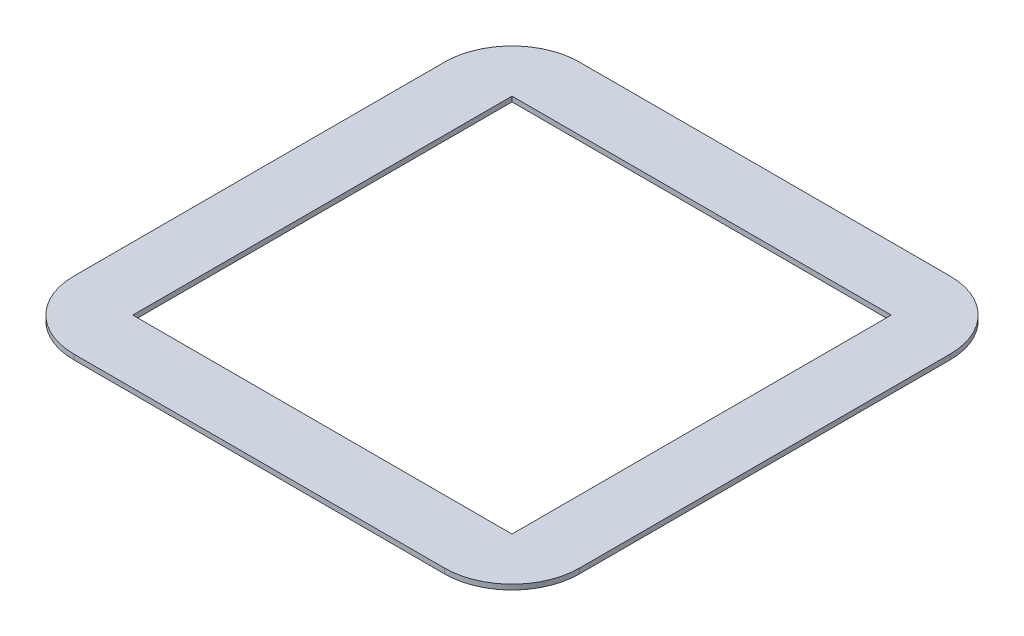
ISO-10303-21;
HEADER;
FILE_DESCRIPTION(('STEP AP214'),'2;1');
FILE_NAME('part.step','',(''),(''),'','','');
FILE_SCHEMA(('AUTOMOTIVE_DESIGN { 1 0 10303 214 1 1 1 1 }'));
ENDSEC;
DATA;
#1=APPLICATION_CONTEXT('core data for automotive mechanical design processes');
#2=APPLICATION_PROTOCOL_DEFINITION('international standard','automotive_design',2000,#1);
#3=PRODUCT_CONTEXT('',#1,'mechanical');
#4=PRODUCT('Part','Part','',(#3));
#5=PRODUCT_RELATED_PRODUCT_CATEGORY('part','',(#4));
#6=PRODUCT_DEFINITION_FORMATION('','',#4);
#7=PRODUCT_DEFINITION_CONTEXT('part definition',#1,'design');
#8=PRODUCT_DEFINITION('design','',#6,#7);
#9=PRODUCT_DEFINITION_SHAPE('','',#8);
#10=(LENGTH_UNIT() NAMED_UNIT(*) SI_UNIT(.MILLI.,.METRE.));
#11=(NAMED_UNIT(*) PLANE_ANGLE_UNIT() SI_UNIT($,.RADIAN.));
#12=(NAMED_UNIT(*) SI_UNIT($,.STERADIAN.) SOLID_ANGLE_UNIT());
#13=UNCERTAINTY_MEASURE_WITH_UNIT(LENGTH_MEASURE(1.E-05),#10,'distance_accuracy_value','');
#14=(GEOMETRIC_REPRESENTATION_CONTEXT(3) GLOBAL_UNCERTAINTY_ASSIGNED_CONTEXT((#13)) GLOBAL_UNIT_ASSIGNED_CONTEXT((#10,
#11,#12)) REPRESENTATION_CONTEXT('',''));
#15=CARTESIAN_POINT('',(0.,0.,0.));
#16=DIRECTION('',(0.,0.,1.));
#17=DIRECTION('',(1.,0.,0.));
#18=AXIS2_PLACEMENT_3D('',#15,#16,#17);
#19=CARTESIAN_POINT('',(0.,3.,0.));
#20=DIRECTION('',(0.,1.,0.));
#21=DIRECTION('',(0.,0.,1.));
#22=AXIS2_PLACEMENT_3D('',#19,#20,#21);
#23=PLANE('',#22);
#24=DIRECTION('',(-1.,0.,0.));
#25=VECTOR('',#24,1.);
#26=CARTESIAN_POINT('',(-150.,3.,-150.));
#27=LINE('',#26,#25);
#28=CARTESIAN_POINT('',(110.,3.,-150.));
#29=VERTEX_POINT('',#28);
#30=CARTESIAN_POINT('',(-110.,3.,-150.));
#31=VERTEX_POINT('',#30);
#32=EDGE_CURVE('E168',#29,#31,#27,.T.);
#33=ORIENTED_EDGE('',*,*,#32,.T.);
#34=CARTESIAN_POINT('',(-110.,3.,-110.));
#35=DIRECTION('',(0.,1.,0.));
#36=DIRECTION('',(0.,0.,1.));
#37=AXIS2_PLACEMENT_3D('',#34,#35,#36);
#38=CIRCLE('',#37,40.);
#39=CARTESIAN_POINT('',(-150.,3.,-110.));
#40=VERTEX_POINT('',#39);
#41=EDGE_CURVE('E208',#31,#40,#38,.T.);
#42=ORIENTED_EDGE('',*,*,#41,.T.);
#43=DIRECTION('',(0.,0.,1.));
#44=VECTOR('',#43,1.);
#45=CARTESIAN_POINT('',(-150.,3.,-150.));
#46=LINE('',#45,#44);
#47=CARTESIAN_POINT('',(-150.,3.,110.));
#48=VERTEX_POINT('',#47);
#49=EDGE_CURVE('E172',#40,#48,#46,.T.);
#50=ORIENTED_EDGE('',*,*,#49,.T.);
#51=CARTESIAN_POINT('',(-110.,3.,110.));
#52=DIRECTION('',(0.,1.,0.));
#53=DIRECTION('',(0.,0.,1.));
#54=AXIS2_PLACEMENT_3D('',#51,#52,#53);
#55=CIRCLE('',#54,40.);
#56=CARTESIAN_POINT('',(-110.,3.,150.));
#57=VERTEX_POINT('',#56);
#58=EDGE_CURVE('E55',#48,#57,#55,.T.);
#59=ORIENTED_EDGE('',*,*,#58,.T.);
#60=DIRECTION('',(1.,0.,0.));
#61=VECTOR('',#60,1.);
#62=CARTESIAN_POINT('',(-150.,3.,150.));
#63=LINE('',#62,#61);
#64=CARTESIAN_POINT('',(110.,3.,150.));
#65=VERTEX_POINT('',#64);
#66=EDGE_CURVE('E174',#57,#65,#63,.T.);
#67=ORIENTED_EDGE('',*,*,#66,.T.);
#68=CARTESIAN_POINT('',(110.,3.,110.));
#69=DIRECTION('',(0.,1.,0.));
#70=DIRECTION('',(0.,0.,1.));
#71=AXIS2_PLACEMENT_3D('',#68,#69,#70);
#72=CIRCLE('',#71,40.);
#73=CARTESIAN_POINT('',(150.,3.,110.));
#74=VERTEX_POINT('',#73);
#75=EDGE_CURVE('E203',#65,#74,#72,.T.);
#76=ORIENTED_EDGE('',*,*,#75,.T.);
#77=DIRECTION('',(0.,0.,-1.));
#78=VECTOR('',#77,1.);
#79=CARTESIAN_POINT('',(150.,3.,-150.));
#80=LINE('',#79,#78);
#81=CARTESIAN_POINT('',(150.,3.,-110.));
#82=VERTEX_POINT('',#81);
#83=EDGE_CURVE('E165',#74,#82,#80,.T.);
#84=ORIENTED_EDGE('',*,*,#83,.T.);
#85=CARTESIAN_POINT('',(110.,3.,-110.));
#86=DIRECTION('',(0.,1.,0.));
#87=DIRECTION('',(0.,0.,1.));
#88=AXIS2_PLACEMENT_3D('',#85,#86,#87);
#89=CIRCLE('',#88,40.);
#90=EDGE_CURVE('E205',#82,#29,#89,.T.);
#91=ORIENTED_EDGE('',*,*,#90,.T.);
#92=EDGE_LOOP('',(#33,#42,#50,#59,#67,#76,#84,#91));
#93=FACE_BOUND('',#92,.T.);
#94=DIRECTION('',(1.,0.,0.));
#95=VECTOR('',#94,1.);
#96=CARTESIAN_POINT('',(112.5,3.,112.5));
#97=LINE('',#96,#95);
#98=CARTESIAN_POINT('',(-112.5,3.,112.5));
#99=VERTEX_POINT('',#98);
#100=CARTESIAN_POINT('',(112.5,3.,112.5));
#101=VERTEX_POINT('',#100);
#102=EDGE_CURVE('E134',#99,#101,#97,.T.);
#103=ORIENTED_EDGE('',*,*,#102,.F.);
#104=DIRECTION('',(0.,0.,1.));
#105=VECTOR('',#104,1.);
#106=CARTESIAN_POINT('',(-112.5,3.,-112.5));
#107=LINE('',#106,#105);
#108=CARTESIAN_POINT('',(-112.5,3.,-112.5));
#109=VERTEX_POINT('',#108);
#110=EDGE_CURVE('E124',#109,#99,#107,.T.);
#111=ORIENTED_EDGE('',*,*,#110,.F.);
#112=DIRECTION('',(-1.,0.,0.));
#113=VECTOR('',#112,1.);
#114=CARTESIAN_POINT('',(112.5,3.,-112.5));
#115=LINE('',#114,#113);
#116=CARTESIAN_POINT('',(112.5,3.,-112.5));
#117=VERTEX_POINT('',#116);
#118=EDGE_CURVE('E149',#117,#109,#115,.T.);
#119=ORIENTED_EDGE('',*,*,#118,.F.);
#120=DIRECTION('',(0.,0.,-1.));
#121=VECTOR('',#120,1.);
#122=CARTESIAN_POINT('',(112.5,3.,-112.5));
#123=LINE('',#122,#121);
#124=EDGE_CURVE('E147',#101,#117,#123,.T.);
#125=ORIENTED_EDGE('',*,*,#124,.F.);
#126=EDGE_LOOP('',(#103,#111,#119,#125));
#127=FACE_BOUND('',#126,.T.);
#128=ADVANCED_FACE('F33',(#93,#127),#23,.T.);
#129=CARTESIAN_POINT('',(0.,0.,0.));
#130=DIRECTION('',(0.,1.,0.));
#131=DIRECTION('',(0.,0.,1.));
#132=AXIS2_PLACEMENT_3D('',#129,#130,#131);
#133=PLANE('',#132);
#134=DIRECTION('',(0.,0.,1.));
#135=VECTOR('',#134,1.);
#136=CARTESIAN_POINT('',(-150.,0.,-150.));
#137=LINE('',#136,#135);
#138=CARTESIAN_POINT('',(-150.,0.,-110.));
#139=VERTEX_POINT('',#138);
#140=CARTESIAN_POINT('',(-150.,0.,110.));
#141=VERTEX_POINT('',#140);
#142=EDGE_CURVE('E182',#139,#141,#137,.T.);
#143=ORIENTED_EDGE('',*,*,#142,.F.);
#144=CARTESIAN_POINT('',(-110.,0.,-110.));
#145=DIRECTION('',(0.,1.,0.));
#146=DIRECTION('',(0.,0.,1.));
#147=AXIS2_PLACEMENT_3D('',#144,#145,#146);
#148=CIRCLE('',#147,40.);
#149=CARTESIAN_POINT('',(-110.,0.,-150.));
#150=VERTEX_POINT('',#149);
#151=EDGE_CURVE('E196',#139,#150,#148,.F.);
#152=ORIENTED_EDGE('',*,*,#151,.T.);
#153=DIRECTION('',(-1.,0.,0.));
#154=VECTOR('',#153,1.);
#155=CARTESIAN_POINT('',(-150.,0.,-150.));
#156=LINE('',#155,#154);
#157=CARTESIAN_POINT('',(110.,0.,-150.));
#158=VERTEX_POINT('',#157);
#159=EDGE_CURVE('E179',#158,#150,#156,.T.);
#160=ORIENTED_EDGE('',*,*,#159,.F.);
#161=CARTESIAN_POINT('',(110.,0.,-110.));
#162=DIRECTION('',(0.,1.,0.));
#163=DIRECTION('',(0.,0.,1.));
#164=AXIS2_PLACEMENT_3D('',#161,#162,#163);
#165=CIRCLE('',#164,40.);
#166=CARTESIAN_POINT('',(150.,0.,-110.));
#167=VERTEX_POINT('',#166);
#168=EDGE_CURVE('E192',#158,#167,#165,.F.);
#169=ORIENTED_EDGE('',*,*,#168,.T.);
#170=DIRECTION('',(0.,0.,-1.));
#171=VECTOR('',#170,1.);
#172=CARTESIAN_POINT('',(150.,0.,-150.));
#173=LINE('',#172,#171);
#174=CARTESIAN_POINT('',(150.,0.,110.));
#175=VERTEX_POINT('',#174);
#176=EDGE_CURVE('E142',#175,#167,#173,.T.);
#177=ORIENTED_EDGE('',*,*,#176,.F.);
#178=CARTESIAN_POINT('',(110.,0.,110.));
#179=DIRECTION('',(0.,1.,0.));
#180=DIRECTION('',(0.,0.,1.));
#181=AXIS2_PLACEMENT_3D('',#178,#179,#180);
#182=CIRCLE('',#181,40.);
#183=CARTESIAN_POINT('',(110.,0.,150.));
#184=VERTEX_POINT('',#183);
#185=EDGE_CURVE('E190',#175,#184,#182,.F.);
#186=ORIENTED_EDGE('',*,*,#185,.T.);
#187=DIRECTION('',(1.,0.,0.));
#188=VECTOR('',#187,1.);
#189=CARTESIAN_POINT('',(-150.,0.,150.));
#190=LINE('',#189,#188);
#191=CARTESIAN_POINT('',(-110.,0.,150.));
#192=VERTEX_POINT('',#191);
#193=EDGE_CURVE('E169',#192,#184,#190,.T.);
#194=ORIENTED_EDGE('',*,*,#193,.F.);
#195=CARTESIAN_POINT('',(-110.,0.,110.));
#196=DIRECTION('',(0.,1.,0.));
#197=DIRECTION('',(0.,0.,1.));
#198=AXIS2_PLACEMENT_3D('',#195,#196,#197);
#199=CIRCLE('',#198,40.);
#200=EDGE_CURVE('E194',#192,#141,#199,.F.);
#201=ORIENTED_EDGE('',*,*,#200,.T.);
#202=EDGE_LOOP('',(#143,#152,#160,#169,#177,#186,#194,#201));
#203=FACE_BOUND('',#202,.T.);
#204=DIRECTION('',(0.,0.,1.));
#205=VECTOR('',#204,1.);
#206=CARTESIAN_POINT('',(-112.5,0.,-112.5));
#207=LINE('',#206,#205);
#208=CARTESIAN_POINT('',(-112.5,0.,-112.5));
#209=VERTEX_POINT('',#208);
#210=CARTESIAN_POINT('',(-112.5,0.,112.5));
#211=VERTEX_POINT('',#210);
#212=EDGE_CURVE('E153',#209,#211,#207,.T.);
#213=ORIENTED_EDGE('',*,*,#212,.T.);
#214=DIRECTION('',(1.,0.,0.));
#215=VECTOR('',#214,1.);
#216=CARTESIAN_POINT('',(112.5,0.,112.5));
#217=LINE('',#216,#215);
#218=CARTESIAN_POINT('',(112.5,0.,112.5));
#219=VERTEX_POINT('',#218);
#220=EDGE_CURVE('E141',#211,#219,#217,.T.);
#221=ORIENTED_EDGE('',*,*,#220,.T.);
#222=DIRECTION('',(0.,0.,-1.));
#223=VECTOR('',#222,1.);
#224=CARTESIAN_POINT('',(112.5,0.,-112.5));
#225=LINE('',#224,#223);
#226=CARTESIAN_POINT('',(112.5,0.,-112.5));
#227=VERTEX_POINT('',#226);
#228=EDGE_CURVE('E156',#219,#227,#225,.T.);
#229=ORIENTED_EDGE('',*,*,#228,.T.);
#230=DIRECTION('',(-1.,0.,0.));
#231=VECTOR('',#230,1.);
#232=CARTESIAN_POINT('',(112.5,0.,-112.5));
#233=LINE('',#232,#231);
#234=EDGE_CURVE('E135',#227,#209,#233,.T.);
#235=ORIENTED_EDGE('',*,*,#234,.T.);
#236=EDGE_LOOP('',(#213,#221,#229,#235));
#237=FACE_BOUND('',#236,.T.);
#238=ADVANCED_FACE('F224',(#203,#237),#133,.F.);
#239=CARTESIAN_POINT('',(150.,3.,-150.));
#240=DIRECTION('',(-1.,0.,0.));
#241=DIRECTION('',(0.,0.,1.));
#242=AXIS2_PLACEMENT_3D('',#239,#240,#241);
#243=PLANE('',#242);
#244=ORIENTED_EDGE('',*,*,#176,.T.);
#245=DIRECTION('',(0.,-1.,0.));
#246=VECTOR('',#245,1.);
#247=CARTESIAN_POINT('',(150.,3.,-110.));
#248=LINE('',#247,#246);
#249=EDGE_CURVE('E11',#167,#82,#248,.F.);
#250=ORIENTED_EDGE('',*,*,#249,.T.);
#251=ORIENTED_EDGE('',*,*,#83,.F.);
#252=DIRECTION('',(0.,-1.,0.));
#253=VECTOR('',#252,1.);
#254=CARTESIAN_POINT('',(150.,3.,110.));
#255=LINE('',#254,#253);
#256=EDGE_CURVE('E41',#74,#175,#255,.T.);
#257=ORIENTED_EDGE('',*,*,#256,.T.);
#258=EDGE_LOOP('',(#244,#250,#251,#257));
#259=FACE_BOUND('',#258,.T.);
#260=ADVANCED_FACE('F218',(#259),#243,.F.);
#261=CARTESIAN_POINT('',(-150.,3.,-150.));
#262=DIRECTION('',(0.,0.,1.));
#263=DIRECTION('',(1.,0.,0.));
#264=AXIS2_PLACEMENT_3D('',#261,#262,#263);
#265=PLANE('',#264);
#266=ORIENTED_EDGE('',*,*,#159,.T.);
#267=DIRECTION('',(0.,-1.,0.));
#268=VECTOR('',#267,1.);
#269=CARTESIAN_POINT('',(-110.,3.,-150.));
#270=LINE('',#269,#268);
#271=EDGE_CURVE('E201',#150,#31,#270,.F.);
#272=ORIENTED_EDGE('',*,*,#271,.T.);
#273=ORIENTED_EDGE('',*,*,#32,.F.);
#274=DIRECTION('',(0.,-1.,0.));
#275=VECTOR('',#274,1.);
#276=CARTESIAN_POINT('',(110.,3.,-150.));
#277=LINE('',#276,#275);
#278=EDGE_CURVE('E198',#29,#158,#277,.T.);
#279=ORIENTED_EDGE('',*,*,#278,.T.);
#280=EDGE_LOOP('',(#266,#272,#273,#279));
#281=FACE_BOUND('',#280,.T.);
#282=ADVANCED_FACE('F234',(#281),#265,.F.);
#283=CARTESIAN_POINT('',(-150.,3.,-150.));
#284=DIRECTION('',(1.,0.,0.));
#285=DIRECTION('',(0.,0.,-1.));
#286=AXIS2_PLACEMENT_3D('',#283,#284,#285);
#287=PLANE('',#286);
#288=ORIENTED_EDGE('',*,*,#49,.F.);
#289=DIRECTION('',(0.,-1.,0.));
#290=VECTOR('',#289,1.);
#291=CARTESIAN_POINT('',(-150.,3.,-110.));
#292=LINE('',#291,#290);
#293=EDGE_CURVE('E187',#40,#139,#292,.T.);
#294=ORIENTED_EDGE('',*,*,#293,.T.);
#295=ORIENTED_EDGE('',*,*,#142,.T.);
#296=DIRECTION('',(0.,-1.,0.));
#297=VECTOR('',#296,1.);
#298=CARTESIAN_POINT('',(-150.,3.,110.));
#299=LINE('',#298,#297);
#300=EDGE_CURVE('E176',#141,#48,#299,.F.);
#301=ORIENTED_EDGE('',*,*,#300,.T.);
#302=EDGE_LOOP('',(#288,#294,#295,#301));
#303=FACE_BOUND('',#302,.T.);
#304=ADVANCED_FACE('F242',(#303),#287,.F.);
#305=CARTESIAN_POINT('',(-150.,3.,150.));
#306=DIRECTION('',(0.,0.,-1.));
#307=DIRECTION('',(-1.,0.,0.));
#308=AXIS2_PLACEMENT_3D('',#305,#306,#307);
#309=PLANE('',#308);
#310=ORIENTED_EDGE('',*,*,#66,.F.);
#311=DIRECTION('',(0.,-1.,0.));
#312=VECTOR('',#311,1.);
#313=CARTESIAN_POINT('',(-110.,3.,150.));
#314=LINE('',#313,#312);
#315=EDGE_CURVE('E211',#57,#192,#314,.T.);
#316=ORIENTED_EDGE('',*,*,#315,.T.);
#317=ORIENTED_EDGE('',*,*,#193,.T.);
#318=DIRECTION('',(0.,-1.,0.));
#319=VECTOR('',#318,1.);
#320=CARTESIAN_POINT('',(110.,3.,150.));
#321=LINE('',#320,#319);
#322=EDGE_CURVE('E48',#184,#65,#321,.F.);
#323=ORIENTED_EDGE('',*,*,#322,.T.);
#324=EDGE_LOOP('',(#310,#316,#317,#323));
#325=FACE_BOUND('',#324,.T.);
#326=ADVANCED_FACE('F247',(#325),#309,.F.);
#327=CARTESIAN_POINT('',(-112.5,3.,-112.5));
#328=DIRECTION('',(1.,0.,0.));
#329=DIRECTION('',(0.,0.,-1.));
#330=AXIS2_PLACEMENT_3D('',#327,#328,#329);
#331=PLANE('',#330);
#332=ORIENTED_EDGE('',*,*,#212,.F.);
#333=DIRECTION('',(0.,-1.,0.));
#334=VECTOR('',#333,1.);
#335=CARTESIAN_POINT('',(-112.5,3.,-112.5));
#336=LINE('',#335,#334);
#337=EDGE_CURVE('E130',#109,#209,#336,.T.);
#338=ORIENTED_EDGE('',*,*,#337,.F.);
#339=ORIENTED_EDGE('',*,*,#110,.T.);
#340=DIRECTION('',(0.,-1.,0.));
#341=VECTOR('',#340,1.);
#342=CARTESIAN_POINT('',(-112.5,3.,112.5));
#343=LINE('',#342,#341);
#344=EDGE_CURVE('E127',#99,#211,#343,.T.);
#345=ORIENTED_EDGE('',*,*,#344,.T.);
#346=EDGE_LOOP('',(#332,#338,#339,#345));
#347=FACE_BOUND('',#346,.T.);
#348=ADVANCED_FACE('F126',(#347),#331,.T.);
#349=CARTESIAN_POINT('',(112.5,3.,112.5));
#350=DIRECTION('',(0.,0.,-1.));
#351=DIRECTION('',(-1.,0.,0.));
#352=AXIS2_PLACEMENT_3D('',#349,#350,#351);
#353=PLANE('',#352);
#354=ORIENTED_EDGE('',*,*,#220,.F.);
#355=ORIENTED_EDGE('',*,*,#344,.F.);
#356=ORIENTED_EDGE('',*,*,#102,.T.);
#357=DIRECTION('',(0.,-1.,0.));
#358=VECTOR('',#357,1.);
#359=CARTESIAN_POINT('',(112.5,3.,112.5));
#360=LINE('',#359,#358);
#361=EDGE_CURVE('E143',#101,#219,#360,.T.);
#362=ORIENTED_EDGE('',*,*,#361,.T.);
#363=EDGE_LOOP('',(#354,#355,#356,#362));
#364=FACE_BOUND('',#363,.T.);
#365=ADVANCED_FACE('F138',(#364),#353,.T.);
#366=CARTESIAN_POINT('',(112.5,3.,-112.5));
#367=DIRECTION('',(-1.,0.,0.));
#368=DIRECTION('',(0.,0.,1.));
#369=AXIS2_PLACEMENT_3D('',#366,#367,#368);
#370=PLANE('',#369);
#371=ORIENTED_EDGE('',*,*,#228,.F.);
#372=ORIENTED_EDGE('',*,*,#361,.F.);
#373=ORIENTED_EDGE('',*,*,#124,.T.);
#374=DIRECTION('',(0.,-1.,0.));
#375=VECTOR('',#374,1.);
#376=CARTESIAN_POINT('',(112.5,3.,-112.5));
#377=LINE('',#376,#375);
#378=EDGE_CURVE('E162',#117,#227,#377,.T.);
#379=ORIENTED_EDGE('',*,*,#378,.T.);
#380=EDGE_LOOP('',(#371,#372,#373,#379));
#381=FACE_BOUND('',#380,.T.);
#382=ADVANCED_FACE('F302',(#381),#370,.T.);
#383=CARTESIAN_POINT('',(112.5,3.,-112.5));
#384=DIRECTION('',(0.,0.,1.));
#385=DIRECTION('',(1.,0.,0.));
#386=AXIS2_PLACEMENT_3D('',#383,#384,#385);
#387=PLANE('',#386);
#388=ORIENTED_EDGE('',*,*,#234,.F.);
#389=ORIENTED_EDGE('',*,*,#378,.F.);
#390=ORIENTED_EDGE('',*,*,#118,.T.);
#391=ORIENTED_EDGE('',*,*,#337,.T.);
#392=EDGE_LOOP('',(#388,#389,#390,#391));
#393=FACE_BOUND('',#392,.T.);
#394=ADVANCED_FACE('F271',(#393),#387,.T.);
#395=CARTESIAN_POINT('',(-110.,3.,-110.));
#396=DIRECTION('',(0.,-1.,0.));
#397=DIRECTION('',(0.,0.,-1.));
#398=AXIS2_PLACEMENT_3D('',#395,#396,#397);
#399=CYLINDRICAL_SURFACE('',#398,40.);
#400=ORIENTED_EDGE('',*,*,#41,.F.);
#401=ORIENTED_EDGE('',*,*,#271,.F.);
#402=ORIENTED_EDGE('',*,*,#151,.F.);
#403=ORIENTED_EDGE('',*,*,#293,.F.);
#404=EDGE_LOOP('',(#400,#401,#402,#403));
#405=FACE_BOUND('',#404,.T.);
#406=ADVANCED_FACE('F240',(#405),#399,.T.);
#407=CARTESIAN_POINT('',(-110.,3.,110.));
#408=DIRECTION('',(0.,-1.,0.));
#409=DIRECTION('',(0.,0.,-1.));
#410=AXIS2_PLACEMENT_3D('',#407,#408,#409);
#411=CYLINDRICAL_SURFACE('',#410,40.);
#412=ORIENTED_EDGE('',*,*,#58,.F.);
#413=ORIENTED_EDGE('',*,*,#300,.F.);
#414=ORIENTED_EDGE('',*,*,#200,.F.);
#415=ORIENTED_EDGE('',*,*,#315,.F.);
#416=EDGE_LOOP('',(#412,#413,#414,#415));
#417=FACE_BOUND('',#416,.T.);
#418=ADVANCED_FACE('F246',(#417),#411,.T.);
#419=CARTESIAN_POINT('',(110.,3.,-110.));
#420=DIRECTION('',(0.,-1.,0.));
#421=DIRECTION('',(0.,0.,-1.));
#422=AXIS2_PLACEMENT_3D('',#419,#420,#421);
#423=CYLINDRICAL_SURFACE('',#422,40.);
#424=ORIENTED_EDGE('',*,*,#90,.F.);
#425=ORIENTED_EDGE('',*,*,#249,.F.);
#426=ORIENTED_EDGE('',*,*,#168,.F.);
#427=ORIENTED_EDGE('',*,*,#278,.F.);
#428=EDGE_LOOP('',(#424,#425,#426,#427));
#429=FACE_BOUND('',#428,.T.);
#430=ADVANCED_FACE('F231',(#429),#423,.T.);
#431=CARTESIAN_POINT('',(110.,3.,110.));
#432=DIRECTION('',(0.,-1.,0.));
#433=DIRECTION('',(0.,0.,-1.));
#434=AXIS2_PLACEMENT_3D('',#431,#432,#433);
#435=CYLINDRICAL_SURFACE('',#434,40.);
#436=ORIENTED_EDGE('',*,*,#75,.F.);
#437=ORIENTED_EDGE('',*,*,#322,.F.);
#438=ORIENTED_EDGE('',*,*,#185,.F.);
#439=ORIENTED_EDGE('',*,*,#256,.F.);
#440=EDGE_LOOP('',(#436,#437,#438,#439));
#441=FACE_BOUND('',#440,.T.);
#442=ADVANCED_FACE('F35',(#441),#435,.T.);
#443=CLOSED_SHELL('',(#128,#238,#260,#282,#304,#326,#348,#365,#382,#394,#406,#418,#430,#442));
#444=MANIFOLD_SOLID_BREP('B2',#443);
#445=ADVANCED_BREP_SHAPE_REPRESENTATION('',(#18,#444),#14);
#446=SHAPE_DEFINITION_REPRESENTATION(#9,#445);
ENDSEC;
END-ISO-10303-21;
